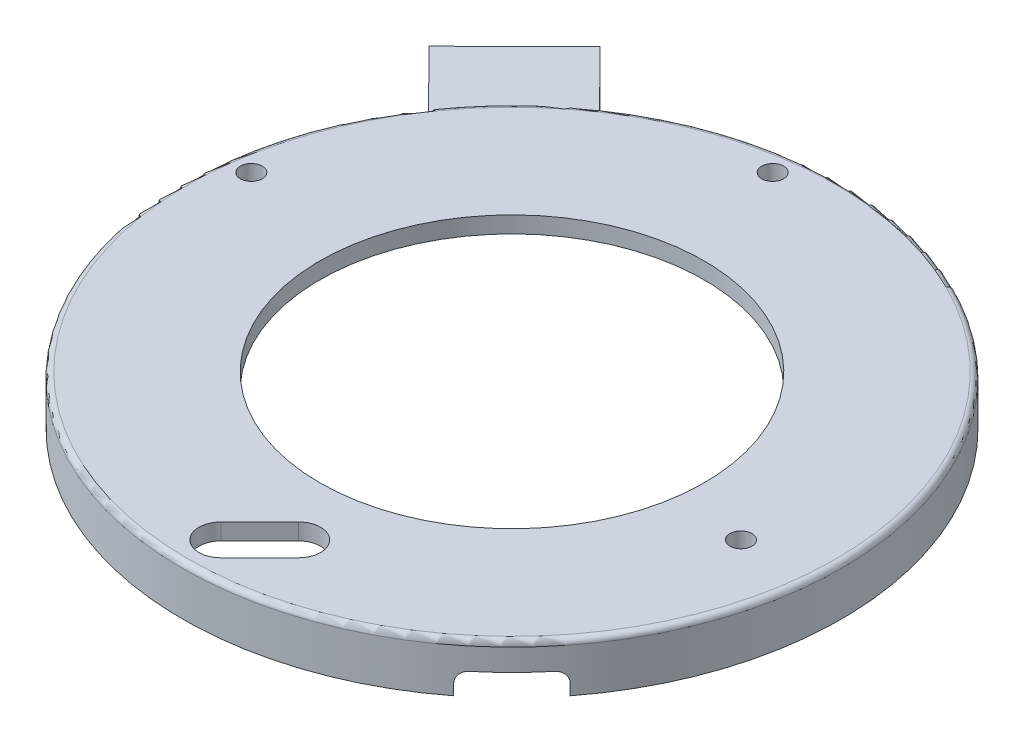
from build123d import *

# Parameters (mm, degrees)
SKETCH_1_R                           = 58
EXTRUDE_1_DEPTH                      = 3
SKETCH_2_R                           = 60
SKETCH_2_R_2                         = 58
EXTRUDE_3_DEPTH                      = 9
CUT_EXTRUDE_5_REACH                  = 144.979
CUT_EXTRUDE_5_END_RADIUS             = 60
CUT_EXTRUDE_5_DIRECTION_2_REACH      = 144.979
CUT_EXTRUDE_5_DIRECTION_2_END_RADIUS = 58
SKETCH_16_R                          = 2.5
EXTRUDE_4_DEPTH                      = 3
SKETCH_17_R                          = 2
EXTRUDE_5_DEPTH                      = 4
FILLET_1_R                           = 1
EXTRUDE_6_DEPTH                      = 3
EXTRUDE_6_DEPTH_BACK                 = 5
EXTRUDE_6_START                      = -3
SKETCH_20_R                          = 2
CUT_EXTRUDE_7_DEPTH                  = 86.647633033
SKETCH_21_R                          = 35
CUT_EXTRUDE_8_DEPTH                  = 10


with BuildPart() as part:
    # Sketch 1 → Extrude 1 (new body)
    with BuildSketch(Plane(origin=(0, 0, 0), x_dir=(1, 0, 0), z_dir=(0, 1, 0))):
        with Locations(Location((0, 0, 0), (0, 0, 270))):
            Circle(SKETCH_1_R)
    extrude(amount=EXTRUDE_1_DEPTH)



with BuildPart() as body_2:
    # Sketch 2 → Extrude 3 (new body)
    with BuildSketch(Plane(origin=(0, 3, 0), x_dir=(1, 0, 0), z_dir=(0, 1, 0))):
        with Locations(Location((0, 0, 0), (0, 0, 270))):
            Circle(SKETCH_2_R)
        with Locations(Location((0, 0, 0), (0, 0, 270))):
            Circle(SKETCH_2_R_2, mode=Mode.SUBTRACT)
    extrude(amount=-EXTRUDE_3_DEPTH)

    # Cut-Extrude 5: up to this cylinder (the profile starts inside it)
    cut_extrude_5_end = Plane(origin=(0, -6.051574, 0), z_dir=(0, 1, 0)) * Cylinder(CUT_EXTRUDE_5_END_RADIUS, 410.958, mode=Mode.PRIVATE)
    # Sketch 15 → Cut-Extrude 5 (cut, up to the surface)
    with BuildSketch(Plane(origin=(41.012193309, 0, 41.012193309), x_dir=(0.7071067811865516, 0, -0.7071067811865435), z_dir=(-0.7071067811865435, 0, -0.7071067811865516)), mode=Mode.PRIVATE) as cut_extrude_5_sk1:
        with BuildLine():
            Line((-7.5, 10), (7.5, 10))
            Line((7.5, 10), (7.5, 4))
            ThreePointArc((7.5, 4), (6.914213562, 2.585786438), (5.5, 2))
            Line((5.5, 2), (-5.5, 2))
            ThreePointArc((-5.5, 2), (-6.914213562, 2.585786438), (-7.5, 4))
            Line((-7.5, 4), (-7.5, 10))
        make_face()
    cut_extrude_5_tool1 = extrude(cut_extrude_5_sk1.sketch, amount=-CUT_EXTRUDE_5_REACH, mode=Mode.PRIVATE) & cut_extrude_5_end
    add(cut_extrude_5_tool1.solids().sort_by_distance((41.012193, -6.051574, 41.012193))[0], mode=Mode.SUBTRACT)

    # Cut-Extrude 5 direction 2: up to this cylinder (the profile starts outside it)
    cut_extrude_5_direction_2_end = Plane(origin=(0, -6.051574, 0), z_dir=(0, 1, 0)) * Cylinder(CUT_EXTRUDE_5_DIRECTION_2_END_RADIUS, 406.958, mode=Mode.PRIVATE)
    # Sketch 15 → Cut-Extrude 5 direction 2 (cut, up to the surface)
    with BuildSketch(Plane(origin=(41.012193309, 0, 41.012193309), x_dir=(0.7071067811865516, 0, -0.7071067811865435), z_dir=(-0.7071067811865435, 0, -0.7071067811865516)), mode=Mode.PRIVATE) as cut_extrude_5_direction_2_sk1:
        with BuildLine():
            Line((-7.5, 10), (7.5, 10))
            Line((7.5, 10), (7.5, 4))
            ThreePointArc((7.5, 4), (6.914213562, 2.585786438), (5.5, 2))
            Line((5.5, 2), (-5.5, 2))
            ThreePointArc((-5.5, 2), (-6.914213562, 2.585786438), (-7.5, 4))
            Line((-7.5, 4), (-7.5, 10))
        make_face()
    cut_extrude_5_direction_2_tool1 = extrude(cut_extrude_5_direction_2_sk1.sketch, amount=CUT_EXTRUDE_5_DIRECTION_2_REACH, mode=Mode.PRIVATE) - cut_extrude_5_direction_2_end
    add(cut_extrude_5_direction_2_tool1.solids().sort_by_distance((41.012193, -6.051574, 41.012193))[0], mode=Mode.SUBTRACT)
    add(cut_extrude_5_direction_2_tool1.solids().sort_by_distance((41.012193, -6.051574, 41.012193))[1], mode=Mode.SUBTRACT)


with BuildPart() as part_1:
    add(part.part)

    add(body_2.part)  # Extrude 4 merges body 2
    # Sketch 16 → Extrude 4 (add)
    with BuildSketch(Plane.XZ):
        with Locations(Location((28.284271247, 28.284271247, 0), (0, 0, 90))):
            Circle(SKETCH_16_R)
    extrude(amount=EXTRUDE_4_DEPTH)

    # Sketch 17 → Extrude 5 (add)
    with BuildSketch(Plane.XZ.offset(3)):
        with Locations(Location((28.284271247, 28.284271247, 0), (0, 0, 270))):
            Circle(SKETCH_17_R)
    extrude(amount=EXTRUDE_5_DEPTH)

    # Fillet 1
    fillet_1_edges = [part_1.edges().sort_by_distance(p)[0] for p in [
        (0, 3, -60),
    ]]
    fillet(fillet_1_edges, radius=FILLET_1_R)

    # Sketch 19 → Extrude 6 (add, two sides: drawn at the far end of the back side and taken through both)
    with BuildSketch(Plane.XZ.offset(6).offset(EXTRUDE_6_START - EXTRUDE_6_DEPTH_BACK)):
        Polygon((-49.339398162, -34.141232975), (-59.900789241, -44.792853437), (-44.259702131, -60.295248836), (-33.700439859, -49.641518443), align=None)
    extrude(amount=EXTRUDE_6_DEPTH + EXTRUDE_6_DEPTH_BACK)

    # Sketch 20 → Cut-Extrude 7 (cut, through all)
    with BuildSketch(Plane(origin=(0, 3, 0), x_dir=(1, 0, 0), z_dir=(0, 1, 0))):
        with Locations(Location((47.343145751, -5.65685425, 0), (0, 0, 270))):
            Circle(SKETCH_20_R)
        with Locations(Location((-55.170253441, 7.7, 0), (0, 0, 270))):
            Circle(SKETCH_20_R)
        with Locations(Location((-7.7, 55.170253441, 0), (0, 0, 270))):
            Circle(SKETCH_20_R)
        with BuildLine():
            Line((-2.828427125, -50.171572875), (4.242640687, -43.100505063))
            ThreePointArc((4.242640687, -43.100505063), (9.899494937, -43.100505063), (9.899494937, -48.757359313))
            Line((9.899494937, -48.757359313), (2.828427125, -55.828427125))
            ThreePointArc((2.828427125, -55.828427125), (-2.828427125, -55.828427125), (-2.828427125, -50.171572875))
        make_face()
    extrude(amount=-CUT_EXTRUDE_7_DEPTH, mode=Mode.SUBTRACT)

    # Sketch 21 → Cut-Extrude 8 (cut)
    with BuildSketch(Plane(origin=(0, 3, 0), x_dir=(1, 0, 0), z_dir=(0, 1, 0))):
        with Locations(Location((0, 0, 0), (0, 0, 270))):
            Circle(SKETCH_21_R)
    extrude(amount=-CUT_EXTRUDE_8_DEPTH, mode=Mode.SUBTRACT)


solid = part_1.part
